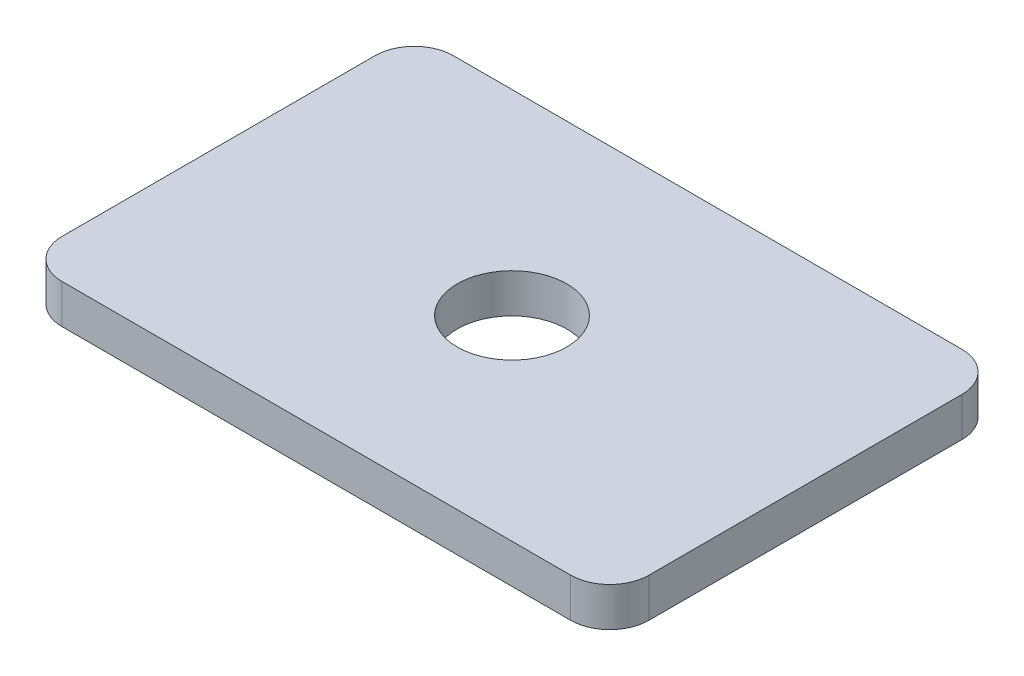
ISO-10303-21;
HEADER;
FILE_DESCRIPTION(('STEP AP214'),'2;1');
FILE_NAME('part.step','',(''),(''),'','','');
FILE_SCHEMA(('AUTOMOTIVE_DESIGN { 1 0 10303 214 1 1 1 1 }'));
ENDSEC;
DATA;
#1=APPLICATION_CONTEXT('core data for automotive mechanical design processes');
#2=APPLICATION_PROTOCOL_DEFINITION('international standard','automotive_design',2000,#1);
#3=PRODUCT_CONTEXT('',#1,'mechanical');
#4=PRODUCT('Part','Part','',(#3));
#5=PRODUCT_RELATED_PRODUCT_CATEGORY('part','',(#4));
#6=PRODUCT_DEFINITION_FORMATION('','',#4);
#7=PRODUCT_DEFINITION_CONTEXT('part definition',#1,'design');
#8=PRODUCT_DEFINITION('design','',#6,#7);
#9=PRODUCT_DEFINITION_SHAPE('','',#8);
#10=(LENGTH_UNIT() NAMED_UNIT(*) SI_UNIT(.MILLI.,.METRE.));
#11=(NAMED_UNIT(*) PLANE_ANGLE_UNIT() SI_UNIT($,.RADIAN.));
#12=(NAMED_UNIT(*) SI_UNIT($,.STERADIAN.) SOLID_ANGLE_UNIT());
#13=UNCERTAINTY_MEASURE_WITH_UNIT(LENGTH_MEASURE(1.E-05),#10,'distance_accuracy_value','');
#14=(GEOMETRIC_REPRESENTATION_CONTEXT(3) GLOBAL_UNCERTAINTY_ASSIGNED_CONTEXT((#13)) GLOBAL_UNIT_ASSIGNED_CONTEXT((#10,
#11,#12)) REPRESENTATION_CONTEXT('',''));
#15=CARTESIAN_POINT('',(0.,0.,0.));
#16=DIRECTION('',(0.,0.,1.));
#17=DIRECTION('',(1.,0.,0.));
#18=AXIS2_PLACEMENT_3D('',#15,#16,#17);
#19=CARTESIAN_POINT('',(-37.5,5.,-25.));
#20=DIRECTION('',(1.,0.,0.));
#21=DIRECTION('',(0.,0.,-1.));
#22=AXIS2_PLACEMENT_3D('',#19,#20,#21);
#23=PLANE('',#22);
#24=DIRECTION('',(0.,0.,1.));
#25=VECTOR('',#24,1.);
#26=CARTESIAN_POINT('',(-37.5,5.,-25.));
#27=LINE('',#26,#25);
#28=CARTESIAN_POINT('',(-37.5,5.,-20.));
#29=VERTEX_POINT('',#28);
#30=CARTESIAN_POINT('',(-37.5,5.,20.));
#31=VERTEX_POINT('',#30);
#32=EDGE_CURVE('E127',#29,#31,#27,.T.);
#33=ORIENTED_EDGE('',*,*,#32,.F.);
#34=DIRECTION('',(0.,-1.,0.));
#35=VECTOR('',#34,1.);
#36=CARTESIAN_POINT('',(-37.5,5.,-20.));
#37=LINE('',#36,#35);
#38=CARTESIAN_POINT('',(-37.5,0.,-20.));
#39=VERTEX_POINT('',#38);
#40=EDGE_CURVE('E11',#29,#39,#37,.T.);
#41=ORIENTED_EDGE('',*,*,#40,.T.);
#42=DIRECTION('',(0.,0.,1.));
#43=VECTOR('',#42,1.);
#44=CARTESIAN_POINT('',(-37.5,0.,-25.));
#45=LINE('',#44,#43);
#46=CARTESIAN_POINT('',(-37.5,0.,20.));
#47=VERTEX_POINT('',#46);
#48=EDGE_CURVE('E129',#39,#47,#45,.T.);
#49=ORIENTED_EDGE('',*,*,#48,.T.);
#50=DIRECTION('',(0.,-1.,0.));
#51=VECTOR('',#50,1.);
#52=CARTESIAN_POINT('',(-37.5,5.,20.));
#53=LINE('',#52,#51);
#54=EDGE_CURVE('E40',#47,#31,#53,.F.);
#55=ORIENTED_EDGE('',*,*,#54,.T.);
#56=EDGE_LOOP('',(#33,#41,#49,#55));
#57=FACE_BOUND('',#56,.T.);
#58=ADVANCED_FACE('F33',(#57),#23,.F.);
#59=CARTESIAN_POINT('',(-37.5,5.,25.));
#60=DIRECTION('',(0.,0.,-1.));
#61=DIRECTION('',(-1.,0.,0.));
#62=AXIS2_PLACEMENT_3D('',#59,#60,#61);
#63=PLANE('',#62);
#64=DIRECTION('',(1.,0.,0.));
#65=VECTOR('',#64,1.);
#66=CARTESIAN_POINT('',(-37.5,0.,25.));
#67=LINE('',#66,#65);
#68=CARTESIAN_POINT('',(-32.5,0.,25.));
#69=VERTEX_POINT('',#68);
#70=CARTESIAN_POINT('',(32.5,0.,25.));
#71=VERTEX_POINT('',#70);
#72=EDGE_CURVE('E125',#69,#71,#67,.T.);
#73=ORIENTED_EDGE('',*,*,#72,.T.);
#74=DIRECTION('',(0.,-1.,0.));
#75=VECTOR('',#74,1.);
#76=CARTESIAN_POINT('',(32.5,5.,25.));
#77=LINE('',#76,#75);
#78=CARTESIAN_POINT('',(32.5,5.,25.));
#79=VERTEX_POINT('',#78);
#80=EDGE_CURVE('E104',#71,#79,#77,.F.);
#81=ORIENTED_EDGE('',*,*,#80,.T.);
#82=DIRECTION('',(1.,0.,0.));
#83=VECTOR('',#82,1.);
#84=CARTESIAN_POINT('',(-37.5,5.,25.));
#85=LINE('',#84,#83);
#86=CARTESIAN_POINT('',(-32.5,5.,25.));
#87=VERTEX_POINT('',#86);
#88=EDGE_CURVE('E135',#87,#79,#85,.T.);
#89=ORIENTED_EDGE('',*,*,#88,.F.);
#90=DIRECTION('',(0.,-1.,0.));
#91=VECTOR('',#90,1.);
#92=CARTESIAN_POINT('',(-32.5,5.,25.));
#93=LINE('',#92,#91);
#94=EDGE_CURVE('E109',#87,#69,#93,.T.);
#95=ORIENTED_EDGE('',*,*,#94,.T.);
#96=EDGE_LOOP('',(#73,#81,#89,#95));
#97=FACE_BOUND('',#96,.T.);
#98=ADVANCED_FACE('F173',(#97),#63,.F.);
#99=CARTESIAN_POINT('',(37.5,5.,-25.));
#100=DIRECTION('',(-1.,0.,0.));
#101=DIRECTION('',(0.,0.,1.));
#102=AXIS2_PLACEMENT_3D('',#99,#100,#101);
#103=PLANE('',#102);
#104=DIRECTION('',(0.,0.,-1.));
#105=VECTOR('',#104,1.);
#106=CARTESIAN_POINT('',(37.5,5.,-25.));
#107=LINE('',#106,#105);
#108=CARTESIAN_POINT('',(37.5,5.,20.));
#109=VERTEX_POINT('',#108);
#110=CARTESIAN_POINT('',(37.5,5.,-20.));
#111=VERTEX_POINT('',#110);
#112=EDGE_CURVE('E118',#109,#111,#107,.T.);
#113=ORIENTED_EDGE('',*,*,#112,.F.);
#114=DIRECTION('',(0.,-1.,0.));
#115=VECTOR('',#114,1.);
#116=CARTESIAN_POINT('',(37.5,5.,20.));
#117=LINE('',#116,#115);
#118=CARTESIAN_POINT('',(37.5,0.,20.));
#119=VERTEX_POINT('',#118);
#120=EDGE_CURVE('E103',#109,#119,#117,.T.);
#121=ORIENTED_EDGE('',*,*,#120,.T.);
#122=DIRECTION('',(0.,0.,-1.));
#123=VECTOR('',#122,1.);
#124=CARTESIAN_POINT('',(37.5,0.,-25.));
#125=LINE('',#124,#123);
#126=CARTESIAN_POINT('',(37.5,0.,-20.));
#127=VERTEX_POINT('',#126);
#128=EDGE_CURVE('E116',#119,#127,#125,.T.);
#129=ORIENTED_EDGE('',*,*,#128,.T.);
#130=DIRECTION('',(0.,-1.,0.));
#131=VECTOR('',#130,1.);
#132=CARTESIAN_POINT('',(37.5,5.,-20.));
#133=LINE('',#132,#131);
#134=EDGE_CURVE('E120',#127,#111,#133,.F.);
#135=ORIENTED_EDGE('',*,*,#134,.T.);
#136=EDGE_LOOP('',(#113,#121,#129,#135));
#137=FACE_BOUND('',#136,.T.);
#138=ADVANCED_FACE('F115',(#137),#103,.F.);
#139=CARTESIAN_POINT('',(-37.5,5.,-25.));
#140=DIRECTION('',(0.,0.,1.));
#141=DIRECTION('',(1.,0.,0.));
#142=AXIS2_PLACEMENT_3D('',#139,#140,#141);
#143=PLANE('',#142);
#144=DIRECTION('',(-1.,0.,0.));
#145=VECTOR('',#144,1.);
#146=CARTESIAN_POINT('',(-37.5,5.,-25.));
#147=LINE('',#146,#145);
#148=CARTESIAN_POINT('',(32.5,5.,-25.));
#149=VERTEX_POINT('',#148);
#150=CARTESIAN_POINT('',(-32.5,5.,-25.));
#151=VERTEX_POINT('',#150);
#152=EDGE_CURVE('E139',#149,#151,#147,.T.);
#153=ORIENTED_EDGE('',*,*,#152,.F.);
#154=DIRECTION('',(0.,-1.,0.));
#155=VECTOR('',#154,1.);
#156=CARTESIAN_POINT('',(32.5,5.,-25.));
#157=LINE('',#156,#155);
#158=CARTESIAN_POINT('',(32.5,0.,-25.));
#159=VERTEX_POINT('',#158);
#160=EDGE_CURVE('E157',#149,#159,#157,.T.);
#161=ORIENTED_EDGE('',*,*,#160,.T.);
#162=DIRECTION('',(-1.,0.,0.));
#163=VECTOR('',#162,1.);
#164=CARTESIAN_POINT('',(-37.5,0.,-25.));
#165=LINE('',#164,#163);
#166=CARTESIAN_POINT('',(-32.5,0.,-25.));
#167=VERTEX_POINT('',#166);
#168=EDGE_CURVE('E124',#159,#167,#165,.T.);
#169=ORIENTED_EDGE('',*,*,#168,.T.);
#170=DIRECTION('',(0.,-1.,0.));
#171=VECTOR('',#170,1.);
#172=CARTESIAN_POINT('',(-32.5,5.,-25.));
#173=LINE('',#172,#171);
#174=EDGE_CURVE('E47',#167,#151,#173,.F.);
#175=ORIENTED_EDGE('',*,*,#174,.T.);
#176=EDGE_LOOP('',(#153,#161,#169,#175));
#177=FACE_BOUND('',#176,.T.);
#178=ADVANCED_FACE('F185',(#177),#143,.F.);
#179=CARTESIAN_POINT('',(-37.5,5.,25.));
#180=DIRECTION('',(0.,1.,0.));
#181=DIRECTION('',(0.,0.,1.));
#182=AXIS2_PLACEMENT_3D('',#179,#180,#181);
#183=PLANE('',#182);
#184=CARTESIAN_POINT('',(0.,5.,0.));
#185=DIRECTION('',(0.,1.,0.));
#186=DIRECTION('',(0.,0.,1.));
#187=AXIS2_PLACEMENT_3D('',#184,#185,#186);
#188=CIRCLE('',#187,7.);
#189=CARTESIAN_POINT('',(0.,5.,7.));
#190=VERTEX_POINT('',#189);
#191=EDGE_CURVE('E176',#190,#190,#188,.T.);
#192=ORIENTED_EDGE('',*,*,#191,.F.);
#193=EDGE_LOOP('',(#192));
#194=FACE_BOUND('',#193,.T.);
#195=ORIENTED_EDGE('',*,*,#88,.T.);
#196=CARTESIAN_POINT('',(32.5,5.,20.));
#197=DIRECTION('',(0.,1.,0.));
#198=DIRECTION('',(0.,0.,1.));
#199=AXIS2_PLACEMENT_3D('',#196,#197,#198);
#200=CIRCLE('',#199,5.);
#201=EDGE_CURVE('E154',#79,#109,#200,.T.);
#202=ORIENTED_EDGE('',*,*,#201,.T.);
#203=ORIENTED_EDGE('',*,*,#112,.T.);
#204=CARTESIAN_POINT('',(32.5,5.,-20.));
#205=DIRECTION('',(0.,1.,0.));
#206=DIRECTION('',(0.,0.,1.));
#207=AXIS2_PLACEMENT_3D('',#204,#205,#206);
#208=CIRCLE('',#207,5.);
#209=EDGE_CURVE('E54',#111,#149,#208,.T.);
#210=ORIENTED_EDGE('',*,*,#209,.T.);
#211=ORIENTED_EDGE('',*,*,#152,.T.);
#212=CARTESIAN_POINT('',(-32.5,5.,-20.));
#213=DIRECTION('',(0.,1.,0.));
#214=DIRECTION('',(0.,0.,1.));
#215=AXIS2_PLACEMENT_3D('',#212,#213,#214);
#216=CIRCLE('',#215,5.);
#217=EDGE_CURVE('E151',#151,#29,#216,.T.);
#218=ORIENTED_EDGE('',*,*,#217,.T.);
#219=ORIENTED_EDGE('',*,*,#32,.T.);
#220=CARTESIAN_POINT('',(-32.5,5.,20.));
#221=DIRECTION('',(0.,1.,0.));
#222=DIRECTION('',(0.,0.,1.));
#223=AXIS2_PLACEMENT_3D('',#220,#221,#222);
#224=CIRCLE('',#223,5.);
#225=EDGE_CURVE('E149',#31,#87,#224,.T.);
#226=ORIENTED_EDGE('',*,*,#225,.T.);
#227=EDGE_LOOP('',(#195,#202,#203,#210,#211,#218,#219,#226));
#228=FACE_BOUND('',#227,.T.);
#229=ADVANCED_FACE('F167',(#194,#228),#183,.T.);
#230=CARTESIAN_POINT('',(-37.5,0.,25.));
#231=DIRECTION('',(0.,1.,0.));
#232=DIRECTION('',(0.,0.,1.));
#233=AXIS2_PLACEMENT_3D('',#230,#231,#232);
#234=PLANE('',#233);
#235=CARTESIAN_POINT('',(0.,0.,0.));
#236=DIRECTION('',(0.,1.,0.));
#237=DIRECTION('',(0.,0.,1.));
#238=AXIS2_PLACEMENT_3D('',#235,#236,#237);
#239=CIRCLE('',#238,7.);
#240=CARTESIAN_POINT('',(0.,0.,7.));
#241=VERTEX_POINT('',#240);
#242=EDGE_CURVE('E174',#241,#241,#239,.T.);
#243=ORIENTED_EDGE('',*,*,#242,.T.);
#244=EDGE_LOOP('',(#243));
#245=FACE_BOUND('',#244,.T.);
#246=ORIENTED_EDGE('',*,*,#128,.F.);
#247=CARTESIAN_POINT('',(32.5,0.,20.));
#248=DIRECTION('',(0.,1.,0.));
#249=DIRECTION('',(0.,0.,1.));
#250=AXIS2_PLACEMENT_3D('',#247,#248,#249);
#251=CIRCLE('',#250,5.);
#252=EDGE_CURVE('E99',#119,#71,#251,.F.);
#253=ORIENTED_EDGE('',*,*,#252,.T.);
#254=ORIENTED_EDGE('',*,*,#72,.F.);
#255=CARTESIAN_POINT('',(-32.5,0.,20.));
#256=DIRECTION('',(0.,1.,0.));
#257=DIRECTION('',(0.,0.,1.));
#258=AXIS2_PLACEMENT_3D('',#255,#256,#257);
#259=CIRCLE('',#258,5.);
#260=EDGE_CURVE('E119',#69,#47,#259,.F.);
#261=ORIENTED_EDGE('',*,*,#260,.T.);
#262=ORIENTED_EDGE('',*,*,#48,.F.);
#263=CARTESIAN_POINT('',(-32.5,0.,-20.));
#264=DIRECTION('',(0.,1.,0.));
#265=DIRECTION('',(0.,0.,1.));
#266=AXIS2_PLACEMENT_3D('',#263,#264,#265);
#267=CIRCLE('',#266,5.);
#268=EDGE_CURVE('E143',#39,#167,#267,.F.);
#269=ORIENTED_EDGE('',*,*,#268,.T.);
#270=ORIENTED_EDGE('',*,*,#168,.F.);
#271=CARTESIAN_POINT('',(32.5,0.,-20.));
#272=DIRECTION('',(0.,1.,0.));
#273=DIRECTION('',(0.,0.,1.));
#274=AXIS2_PLACEMENT_3D('',#271,#272,#273);
#275=CIRCLE('',#274,5.);
#276=EDGE_CURVE('E110',#159,#127,#275,.F.);
#277=ORIENTED_EDGE('',*,*,#276,.T.);
#278=EDGE_LOOP('',(#246,#253,#254,#261,#262,#269,#270,#277));
#279=FACE_BOUND('',#278,.T.);
#280=ADVANCED_FACE('F122',(#245,#279),#234,.F.);
#281=CARTESIAN_POINT('',(32.5,5.,20.));
#282=DIRECTION('',(0.,-1.,0.));
#283=DIRECTION('',(0.,0.,-1.));
#284=AXIS2_PLACEMENT_3D('',#281,#282,#283);
#285=CYLINDRICAL_SURFACE('',#284,5.);
#286=ORIENTED_EDGE('',*,*,#201,.F.);
#287=ORIENTED_EDGE('',*,*,#80,.F.);
#288=ORIENTED_EDGE('',*,*,#252,.F.);
#289=ORIENTED_EDGE('',*,*,#120,.F.);
#290=EDGE_LOOP('',(#286,#287,#288,#289));
#291=FACE_BOUND('',#290,.T.);
#292=ADVANCED_FACE('F102',(#291),#285,.T.);
#293=CARTESIAN_POINT('',(32.5,5.,-20.));
#294=DIRECTION('',(0.,-1.,0.));
#295=DIRECTION('',(0.,0.,-1.));
#296=AXIS2_PLACEMENT_3D('',#293,#294,#295);
#297=CYLINDRICAL_SURFACE('',#296,5.);
#298=ORIENTED_EDGE('',*,*,#209,.F.);
#299=ORIENTED_EDGE('',*,*,#134,.F.);
#300=ORIENTED_EDGE('',*,*,#276,.F.);
#301=ORIENTED_EDGE('',*,*,#160,.F.);
#302=EDGE_LOOP('',(#298,#299,#300,#301));
#303=FACE_BOUND('',#302,.T.);
#304=ADVANCED_FACE('F218',(#303),#297,.T.);
#305=CARTESIAN_POINT('',(-32.5,5.,-20.));
#306=DIRECTION('',(0.,-1.,0.));
#307=DIRECTION('',(0.,0.,-1.));
#308=AXIS2_PLACEMENT_3D('',#305,#306,#307);
#309=CYLINDRICAL_SURFACE('',#308,5.);
#310=ORIENTED_EDGE('',*,*,#217,.F.);
#311=ORIENTED_EDGE('',*,*,#174,.F.);
#312=ORIENTED_EDGE('',*,*,#268,.F.);
#313=ORIENTED_EDGE('',*,*,#40,.F.);
#314=EDGE_LOOP('',(#310,#311,#312,#313));
#315=FACE_BOUND('',#314,.T.);
#316=ADVANCED_FACE('F228',(#315),#309,.T.);
#317=CARTESIAN_POINT('',(-32.5,5.,20.));
#318=DIRECTION('',(0.,-1.,0.));
#319=DIRECTION('',(0.,0.,-1.));
#320=AXIS2_PLACEMENT_3D('',#317,#318,#319);
#321=CYLINDRICAL_SURFACE('',#320,5.);
#322=ORIENTED_EDGE('',*,*,#225,.F.);
#323=ORIENTED_EDGE('',*,*,#54,.F.);
#324=ORIENTED_EDGE('',*,*,#260,.F.);
#325=ORIENTED_EDGE('',*,*,#94,.F.);
#326=EDGE_LOOP('',(#322,#323,#324,#325));
#327=FACE_BOUND('',#326,.T.);
#328=ADVANCED_FACE('F171',(#327),#321,.T.);
#329=CARTESIAN_POINT('',(0.,0.,0.));
#330=DIRECTION('',(0.,1.,0.));
#331=DIRECTION('',(0.,0.,1.));
#332=AXIS2_PLACEMENT_3D('',#329,#330,#331);
#333=CYLINDRICAL_SURFACE('',#332,7.);
#334=ORIENTED_EDGE('',*,*,#242,.F.);
#335=EDGE_LOOP('',(#334));
#336=FACE_BOUND('',#335,.T.);
#337=ORIENTED_EDGE('',*,*,#191,.T.);
#338=EDGE_LOOP('',(#337));
#339=FACE_BOUND('',#338,.T.);
#340=ADVANCED_FACE('F182',(#336,#339),#333,.F.);
#341=CLOSED_SHELL('',(#58,#98,#138,#178,#229,#280,#292,#304,#316,#328,#340));
#342=MANIFOLD_SOLID_BREP('B2',#341);
#343=ADVANCED_BREP_SHAPE_REPRESENTATION('',(#18,#342),#14);
#344=SHAPE_DEFINITION_REPRESENTATION(#9,#343);
ENDSEC;
END-ISO-10303-21;
